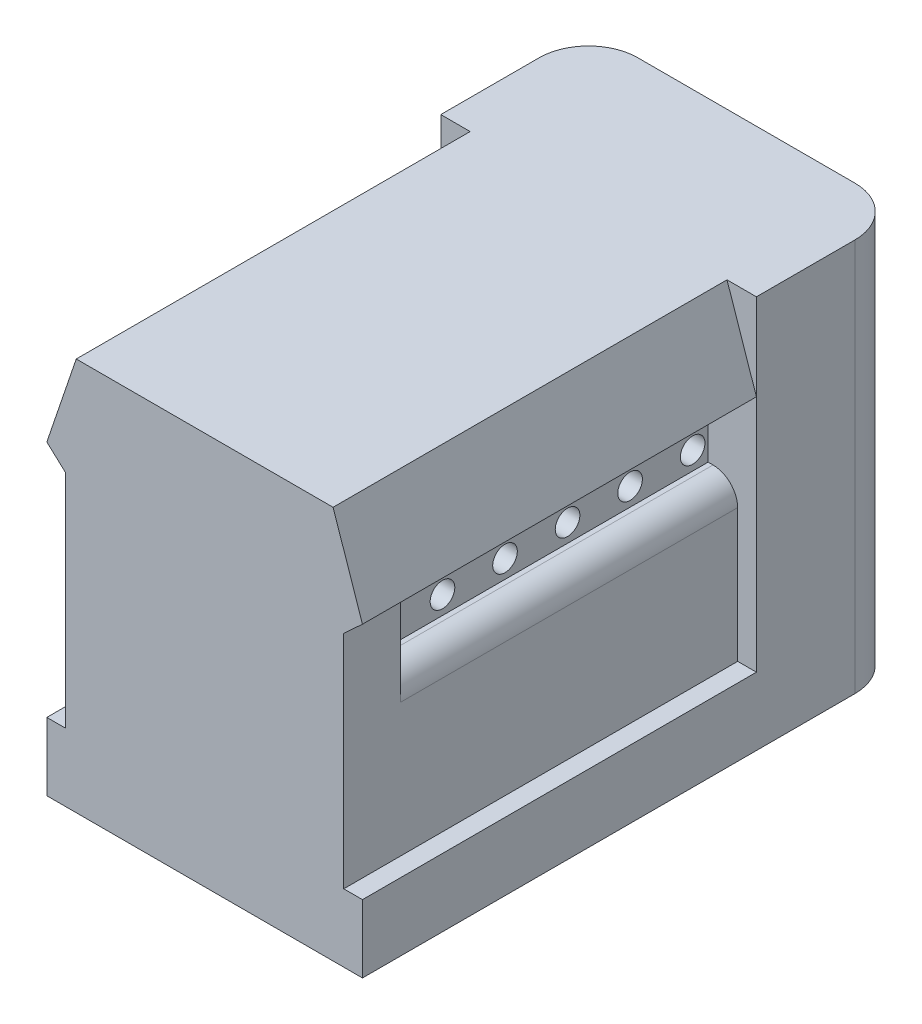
from build123d import *

# Parameters (mm, degrees)
EXTRUSION1_DEPTH           = 16
BOSS_EXTRU_1_DEPTH         = 15.960885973
ENL_V_MAT_EXTRU_1_REACH    = 27.073
ESQUISSE3_R                = 0.5
R_P_TITION_LIN_AIRE1_COUNT = 5
R_P_TITION_LIN_AIRE1_PITCH = 2.54
ESQUISSE4_W                = 10.409192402
ESQUISSE4_H                = 2.3
BOSS_EXTRU_2_DEPTH         = 13
ESQUISSE7_W                = 11.29860034
ESQUISSE7_H                = 2.3
BOSS_EXTRU_3_DEPTH         = 13
ESQUISSE8_R                = 0.4
BOSS_EXTRU_4_DEPTH         = 3


with BuildPart() as part:
    # Esquisse1 → Extrusion1 (new body)
    with BuildSketch(Plane.XY):
        with BuildLine():
            Line((-4.44930017, 10.640971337), (-4.44930017, 9.16466185))
            Line((-4.44930017, 9.16466185), (-4.64930017, 9.16466185))
            ThreePointArc((-4.64930017, 9.16466185), (-5.356406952, 8.871768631), (-5.64930017, 8.16466185))
            Line((-5.64930017, 8.16466185), (-5.64930017, 2.756606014))
            Line((-5.64930017, 2.756606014), (-6.41, 2.756606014))
            Line((-6.41, 2.756606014), (-6.41, 0))
            Line((-6.41, 0), (0, 0))
            Line((0, 0), (6.41, 0))
            Line((6.41, 0), (6.41, 2.756606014))
            Line((6.41, 2.756606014), (5.64930017, 2.756606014))
            Line((5.64930017, 2.756606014), (5.64930017, 8.16466185))
            ThreePointArc((5.64930017, 8.16466185), (5.356406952, 8.871768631), (4.64930017, 9.16466185))
            Line((4.64930017, 9.16466185), (4.44930017, 9.16466185))
            Line((4.44930017, 9.16466185), (4.44930017, 10.640971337))
            Line((4.44930017, 10.640971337), (6.41, 12.444168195))
            Line((6.41, 12.444168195), (5.215643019, 15.960885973))
            Line((5.215643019, 15.960885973), (-5.215643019, 15.960885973))
            Line((-5.215643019, 15.960885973), (-6.41, 12.444168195))
            Line((-6.41, 12.444168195), (-4.44930017, 10.640971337))
        make_face()
    extrude(amount=EXTRUSION1_DEPTH)

    # Esquisse2 → Boss.-Extru.1 (add)
    with BuildSketch(Plane(origin=(0, 15.960885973, 0), x_dir=(1, 0, 0), z_dir=(0, 1, 0))):
        with BuildLine():
            Line((-6.41, 0), (6.41, 0))
            Line((6.41, 0), (6.41, 4))
            ThreePointArc((6.41, 4), (5.824213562, 5.414213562), (4.41, 6))
            Line((4.41, 6), (-4.41, 6))
            ThreePointArc((-4.41, 6), (-5.824213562, 5.414213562), (-6.41, 4))
            Line((-6.41, 4), (-6.41, 0))
        make_face()
    extrude(amount=-BOSS_EXTRU_1_DEPTH)

    # Esquisse3 → Enl_v. mat.-Extru.1 (cut, up to next)
    with BuildSketch(Plane.ZY.offset(4.44930017), mode=Mode.PRIVATE) as enl_v_mat_extru_1_sk1:
        with Locations((0.63, 9.902816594)):
            Circle(ESQUISSE3_R)
    enl_v_mat_extru_1_tool1 = extrude(enl_v_mat_extru_1_sk1.sketch, amount=-ENL_V_MAT_EXTRU_1_REACH, mode=Mode.PRIVATE) & part.part
    enl_v_mat_extru_1 = enl_v_mat_extru_1_tool1.solids().sort_by_distance((-4.4493, 9.902817, 0.63))[0]
    add(enl_v_mat_extru_1, mode=Mode.SUBTRACT)

    # R_p_tition lin_aire1: Enl_v. mat.-Extru.1 ×5
    with Locations(*[(0, 0, i * R_P_TITION_LIN_AIRE1_PITCH) for i in range(1, R_P_TITION_LIN_AIRE1_COUNT)]):
        add(enl_v_mat_extru_1, mode=Mode.SUBTRACT)

    # Esquisse4 → Boss.-Extru.2 (add)
    with BuildSketch(Plane.XZ):
        with Locations((-0.190494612, 14.85)):
            Rectangle(ESQUISSE4_W, ESQUISSE4_H)
    extrude(amount=-BOSS_EXTRU_2_DEPTH)

    # Esquisse7 → Boss.-Extru.3 (add)
    with BuildSketch(Plane.XZ):
        with Locations((0, 14.85)):
            Rectangle(ESQUISSE7_W, ESQUISSE7_H)
    extrude(amount=-BOSS_EXTRU_3_DEPTH)

    # Esquisse8 → Boss.-Extru.4 (add)
    with BuildSketch(Plane.XZ):
        with Locations(Location((-0.007642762, -4.45, 0), (0, 0, 180))):
            Circle(ESQUISSE8_R)
        with Locations(Location((-2.547642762, -4.45, 0), (0, 0, 180))):
            Circle(ESQUISSE8_R)
        with Locations(Location((2.547642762, -4.45, 0), (0, 0, 180))):
            Circle(ESQUISSE8_R)
    extrude(amount=BOSS_EXTRU_4_DEPTH)


solid = part.part
